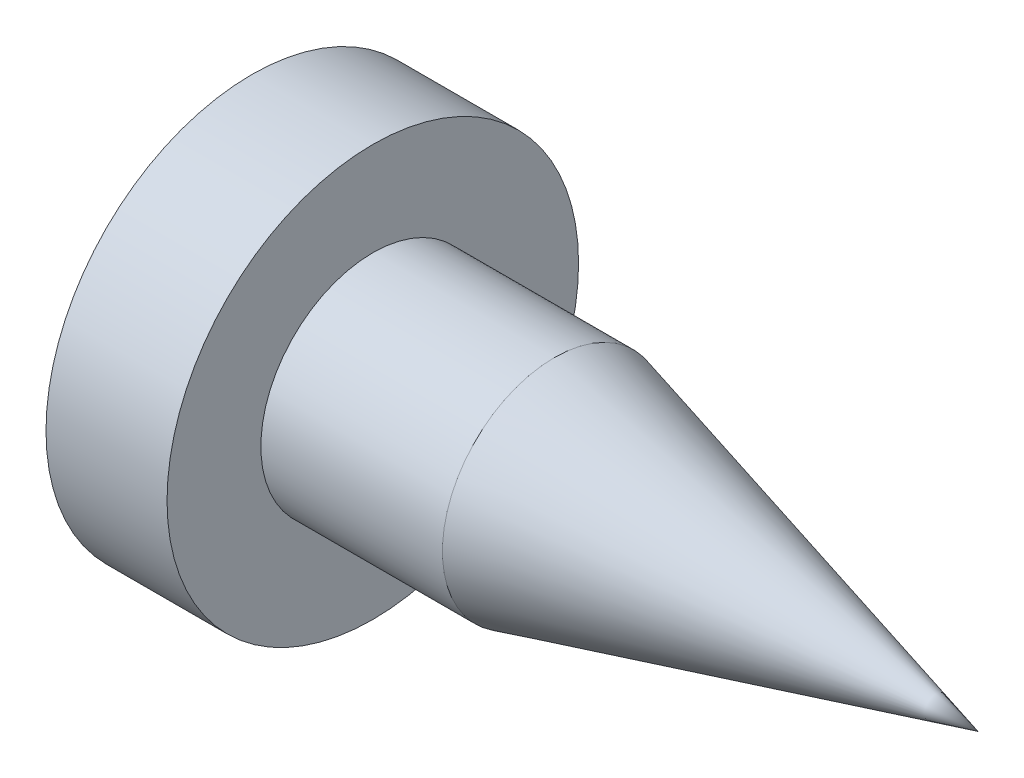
ISO-10303-21;
HEADER;
FILE_DESCRIPTION(('STEP AP214'),'2;1');
FILE_NAME('part.step','',(''),(''),'','','');
FILE_SCHEMA(('AUTOMOTIVE_DESIGN { 1 0 10303 214 1 1 1 1 }'));
ENDSEC;
DATA;
#1=APPLICATION_CONTEXT('core data for automotive mechanical design processes');
#2=APPLICATION_PROTOCOL_DEFINITION('international standard','automotive_design',2000,#1);
#3=PRODUCT_CONTEXT('',#1,'mechanical');
#4=PRODUCT('Part','Part','',(#3));
#5=PRODUCT_RELATED_PRODUCT_CATEGORY('part','',(#4));
#6=PRODUCT_DEFINITION_FORMATION('','',#4);
#7=PRODUCT_DEFINITION_CONTEXT('part definition',#1,'design');
#8=PRODUCT_DEFINITION('design','',#6,#7);
#9=PRODUCT_DEFINITION_SHAPE('','',#8);
#10=(LENGTH_UNIT() NAMED_UNIT(*) SI_UNIT(.MILLI.,.METRE.));
#11=(NAMED_UNIT(*) PLANE_ANGLE_UNIT() SI_UNIT($,.RADIAN.));
#12=(NAMED_UNIT(*) SI_UNIT($,.STERADIAN.) SOLID_ANGLE_UNIT());
#13=UNCERTAINTY_MEASURE_WITH_UNIT(LENGTH_MEASURE(1.E-05),#10,'distance_accuracy_value','');
#14=(GEOMETRIC_REPRESENTATION_CONTEXT(3) GLOBAL_UNCERTAINTY_ASSIGNED_CONTEXT((#13)) GLOBAL_UNIT_ASSIGNED_CONTEXT((#10,
#11,#12)) REPRESENTATION_CONTEXT('',''));
#15=CARTESIAN_POINT('',(0.,0.,0.));
#16=DIRECTION('',(0.,0.,1.));
#17=DIRECTION('',(1.,0.,0.));
#18=AXIS2_PLACEMENT_3D('',#15,#16,#17);
#19=CARTESIAN_POINT('',(10.,0.,0.));
#20=DIRECTION('',(-1.,0.,0.));
#21=DIRECTION('',(0.,-1.,0.));
#22=AXIS2_PLACEMENT_3D('',#19,#20,#21);
#23=CONICAL_SURFACE('',#22,0.,0.258378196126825);
#24=CARTESIAN_POINT('',(3.,0.,0.));
#25=DIRECTION('',(-1.,0.,0.));
#26=DIRECTION('',(0.,-1.,0.));
#27=AXIS2_PLACEMENT_3D('',#24,#25,#26);
#28=CIRCLE('',#27,1.85);
#29=CARTESIAN_POINT('',(3.,-1.85,0.));
#30=VERTEX_POINT('',#29);
#31=EDGE_CURVE('E241',#30,#30,#28,.T.);
#32=ORIENTED_EDGE('',*,*,#31,.F.);
#33=EDGE_LOOP('',(#32));
#34=FACE_BOUND('',#33,.T.);
#35=CARTESIAN_POINT('',(10.,0.,0.));
#36=VERTEX_POINT('',#35);
#37=VERTEX_LOOP('',#36);
#38=FACE_BOUND('',#37,.T.);
#39=ADVANCED_FACE('F30',(#34,#38),#23,.T.);
#40=CARTESIAN_POINT('',(-2.,0.,0.));
#41=DIRECTION('',(-1.,0.,0.));
#42=DIRECTION('',(0.,-1.,0.));
#43=AXIS2_PLACEMENT_3D('',#40,#41,#42);
#44=CYLINDRICAL_SURFACE('',#43,1.85);
#45=CARTESIAN_POINT('',(0.,0.,0.));
#46=DIRECTION('',(-1.,0.,0.));
#47=DIRECTION('',(0.,-1.,0.));
#48=AXIS2_PLACEMENT_3D('',#45,#46,#47);
#49=CIRCLE('',#48,1.84999999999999);
#50=CARTESIAN_POINT('',(0.,-1.84999999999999,0.));
#51=VERTEX_POINT('',#50);
#52=EDGE_CURVE('E238',#51,#51,#49,.T.);
#53=ORIENTED_EDGE('',*,*,#52,.F.);
#54=EDGE_LOOP('',(#53));
#55=FACE_BOUND('',#54,.T.);
#56=ORIENTED_EDGE('',*,*,#31,.T.);
#57=EDGE_LOOP('',(#56));
#58=FACE_BOUND('',#57,.T.);
#59=ADVANCED_FACE('F280',(#55,#58),#44,.T.);
#60=CARTESIAN_POINT('',(0.,3.4,0.));
#61=DIRECTION('',(-1.,0.,0.));
#62=DIRECTION('',(0.,-1.,0.));
#63=AXIS2_PLACEMENT_3D('',#60,#61,#62);
#64=PLANE('',#63);
#65=CARTESIAN_POINT('',(0.,0.,0.));
#66=DIRECTION('',(-1.,0.,0.));
#67=DIRECTION('',(0.,-1.,0.));
#68=AXIS2_PLACEMENT_3D('',#65,#66,#67);
#69=CIRCLE('',#68,3.4);
#70=CARTESIAN_POINT('',(0.,-3.4,0.));
#71=VERTEX_POINT('',#70);
#72=EDGE_CURVE('E235',#71,#71,#69,.T.);
#73=ORIENTED_EDGE('',*,*,#72,.F.);
#74=EDGE_LOOP('',(#73));
#75=FACE_BOUND('',#74,.T.);
#76=ORIENTED_EDGE('',*,*,#52,.T.);
#77=EDGE_LOOP('',(#76));
#78=FACE_BOUND('',#77,.T.);
#79=ADVANCED_FACE('F285',(#75,#78),#64,.F.);
#80=CARTESIAN_POINT('',(-2.,0.,0.));
#81=DIRECTION('',(-1.,0.,0.));
#82=DIRECTION('',(0.,-1.,0.));
#83=AXIS2_PLACEMENT_3D('',#80,#81,#82);
#84=CYLINDRICAL_SURFACE('',#83,3.4);
#85=CARTESIAN_POINT('',(-2.,0.,0.));
#86=DIRECTION('',(-1.,0.,0.));
#87=DIRECTION('',(0.,-1.,0.));
#88=AXIS2_PLACEMENT_3D('',#85,#86,#87);
#89=CIRCLE('',#88,3.4);
#90=CARTESIAN_POINT('',(-2.,-3.4,0.));
#91=VERTEX_POINT('',#90);
#92=EDGE_CURVE('E205',#91,#91,#89,.T.);
#93=ORIENTED_EDGE('',*,*,#92,.F.);
#94=EDGE_LOOP('',(#93));
#95=FACE_BOUND('',#94,.T.);
#96=ORIENTED_EDGE('',*,*,#72,.T.);
#97=EDGE_LOOP('',(#96));
#98=FACE_BOUND('',#97,.T.);
#99=ADVANCED_FACE('F277',(#95,#98),#84,.T.);
#100=CARTESIAN_POINT('',(3.27999999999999,0.,0.));
#101=DIRECTION('',(0.,0.,1.));
#102=DIRECTION('',(1.,0.,0.));
#103=AXIS2_PLACEMENT_3D('',#100,#101,#102);
#104=SPHERICAL_SURFACE('',#103,6.27999999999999);
#105=CARTESIAN_POINT('',(3.27999999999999,0.5,0.));
#106=DIRECTION('',(0.,1.,0.));
#107=DIRECTION('',(0.,0.,1.));
#108=AXIS2_PLACEMENT_3D('',#105,#106,#107);
#109=CIRCLE('',#108,6.26006389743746);
#110=CARTESIAN_POINT('',(-2.9408038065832,0.5,0.700000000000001));
#111=VERTEX_POINT('',#110);
#112=CARTESIAN_POINT('',(-2.65198111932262,0.5,2.));
#113=VERTEX_POINT('',#112);
#114=EDGE_CURVE('E37',#111,#113,#109,.T.);
#115=ORIENTED_EDGE('',*,*,#114,.T.);
#116=CARTESIAN_POINT('',(3.27999999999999,0.,2.));
#117=DIRECTION('',(0.,0.,1.));
#118=DIRECTION('',(1.,0.,0.));
#119=AXIS2_PLACEMENT_3D('',#116,#117,#118);
#120=CIRCLE('',#119,5.95301604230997);
#121=CARTESIAN_POINT('',(-2.65198111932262,-0.5,2.));
#122=VERTEX_POINT('',#121);
#123=EDGE_CURVE('E11',#113,#122,#120,.T.);
#124=ORIENTED_EDGE('',*,*,#123,.T.);
#125=CARTESIAN_POINT('',(3.27999999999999,-0.5,0.));
#126=DIRECTION('',(0.,-1.,0.));
#127=DIRECTION('',(0.,0.,-1.));
#128=AXIS2_PLACEMENT_3D('',#125,#126,#127);
#129=CIRCLE('',#128,6.26006389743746);
#130=CARTESIAN_POINT('',(-2.9408038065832,-0.5,0.700000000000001));
#131=VERTEX_POINT('',#130);
#132=EDGE_CURVE('E145',#122,#131,#129,.T.);
#133=ORIENTED_EDGE('',*,*,#132,.T.);
#134=CARTESIAN_POINT('',(-2.94078129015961,-0.500000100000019,0.700200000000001));
#135=CARTESIAN_POINT('',(-2.94203820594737,-0.499979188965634,0.689050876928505));
#136=CARTESIAN_POINT('',(-2.9431890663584,-0.500909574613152,0.677889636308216));
#137=CARTESIAN_POINT('',(-2.94524990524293,-0.504614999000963,0.65585978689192));
#138=CARTESIAN_POINT('',(-2.94615998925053,-0.507389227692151,0.644991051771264));
#139=CARTESIAN_POINT('',(-2.94771224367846,-0.51472725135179,0.623844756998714));
#140=CARTESIAN_POINT('',(-2.94835421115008,-0.519292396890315,0.613567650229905));
#141=CARTESIAN_POINT('',(-2.94935005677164,-0.530083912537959,0.593914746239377));
#142=CARTESIAN_POINT('',(-2.94970402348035,-0.536309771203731,0.584538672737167));
#143=CARTESIAN_POINT('',(-2.95011190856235,-0.55020035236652,0.567017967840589));
#144=CARTESIAN_POINT('',(-2.95016785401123,-0.557854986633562,0.558865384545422));
#145=CARTESIAN_POINT('',(-2.94998344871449,-0.574413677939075,0.543947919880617));
#146=CARTESIAN_POINT('',(-2.94974305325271,-0.583317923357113,0.537183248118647));
#147=CARTESIAN_POINT('',(-2.94897440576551,-0.602089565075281,0.525251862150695));
#148=CARTESIAN_POINT('',(-2.94844701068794,-0.611954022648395,0.520080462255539));
#149=CARTESIAN_POINT('',(-2.94712049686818,-0.632386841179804,0.511449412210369));
#150=CARTESIAN_POINT('',(-2.94632148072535,-0.642954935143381,0.507989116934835));
#151=CARTESIAN_POINT('',(-2.94474575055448,-0.66134277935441,0.503614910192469));
#152=CARTESIAN_POINT('',(-2.94403058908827,-0.669064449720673,0.502252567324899));
#153=CARTESIAN_POINT('',(-2.94248778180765,-0.684591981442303,0.500441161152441));
#154=CARTESIAN_POINT('',(-2.94166029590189,-0.692397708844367,0.499990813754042));
#155=CARTESIAN_POINT('',(-2.94078129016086,-0.7001999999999,0.500000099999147));
#156=B_SPLINE_CURVE_WITH_KNOTS('',3,(#134,#135,#136,#137,#138,#139,#140,#141,#142,#143,#144,
#145,#146,#147,#148,#149,#150,#151,#152,#153,#154,#155),.UNSPECIFIED.,.F.,.F.,(4,2,2,2,2,2,2,2,
2,2,4),(0.,0.033618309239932,0.0672218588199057,0.1008507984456,0.13446939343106,
0.167859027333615,0.201253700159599,0.234549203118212,0.267832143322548,0.291401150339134,
0.314936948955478),.UNSPECIFIED.);
#157=CARTESIAN_POINT('',(-2.9408038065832,-0.700000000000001,0.5));
#158=VERTEX_POINT('',#157);
#159=EDGE_CURVE('E245',#131,#158,#156,.T.);
#160=ORIENTED_EDGE('',*,*,#159,.T.);
#161=CARTESIAN_POINT('',(3.27999999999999,0.,0.5));
#162=DIRECTION('',(0.,0.,1.));
#163=DIRECTION('',(1.,0.,0.));
#164=AXIS2_PLACEMENT_3D('',#161,#162,#163);
#165=CIRCLE('',#164,6.26006389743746);
#166=CARTESIAN_POINT('',(-2.65198111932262,-2.,0.5));
#167=VERTEX_POINT('',#166);
#168=EDGE_CURVE('E253',#158,#167,#165,.T.);
#169=ORIENTED_EDGE('',*,*,#168,.T.);
#170=CARTESIAN_POINT('',(3.27999999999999,-2.,0.));
#171=DIRECTION('',(0.,-1.,0.));
#172=DIRECTION('',(0.,0.,-1.));
#173=AXIS2_PLACEMENT_3D('',#170,#171,#172);
#174=CIRCLE('',#173,5.95301604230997);
#175=CARTESIAN_POINT('',(-2.65198111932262,-2.,-0.5));
#176=VERTEX_POINT('',#175);
#177=EDGE_CURVE('E522',#167,#176,#174,.T.);
#178=ORIENTED_EDGE('',*,*,#177,.T.);
#179=CARTESIAN_POINT('',(3.27999999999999,0.,-0.5));
#180=DIRECTION('',(0.,0.,-1.));
#181=DIRECTION('',(-1.,0.,0.));
#182=AXIS2_PLACEMENT_3D('',#179,#180,#181);
#183=CIRCLE('',#182,6.26006389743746);
#184=CARTESIAN_POINT('',(-2.9408038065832,-0.700000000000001,-0.5));
#185=VERTEX_POINT('',#184);
#186=EDGE_CURVE('E504',#176,#185,#183,.T.);
#187=ORIENTED_EDGE('',*,*,#186,.T.);
#188=CARTESIAN_POINT('',(-2.94078129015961,-0.700200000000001,-0.500000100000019));
#189=CARTESIAN_POINT('',(-2.94203820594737,-0.689050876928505,-0.499979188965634));
#190=CARTESIAN_POINT('',(-2.9431890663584,-0.677889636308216,-0.500909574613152));
#191=CARTESIAN_POINT('',(-2.94524990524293,-0.65585978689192,-0.504614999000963));
#192=CARTESIAN_POINT('',(-2.94615998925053,-0.644991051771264,-0.507389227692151));
#193=CARTESIAN_POINT('',(-2.94771224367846,-0.623844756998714,-0.51472725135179));
#194=CARTESIAN_POINT('',(-2.94835421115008,-0.613567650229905,-0.519292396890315));
#195=CARTESIAN_POINT('',(-2.94935005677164,-0.593914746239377,-0.530083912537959));
#196=CARTESIAN_POINT('',(-2.94970402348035,-0.584538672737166,-0.536309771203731));
#197=CARTESIAN_POINT('',(-2.95011190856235,-0.567017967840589,-0.55020035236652));
#198=CARTESIAN_POINT('',(-2.95016785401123,-0.558865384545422,-0.557854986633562));
#199=CARTESIAN_POINT('',(-2.94998344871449,-0.543947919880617,-0.574413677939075));
#200=CARTESIAN_POINT('',(-2.94974305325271,-0.537183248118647,-0.583317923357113));
#201=CARTESIAN_POINT('',(-2.9489744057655,-0.525251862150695,-0.602089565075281));
#202=CARTESIAN_POINT('',(-2.94844701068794,-0.520080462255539,-0.611954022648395));
#203=CARTESIAN_POINT('',(-2.94712049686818,-0.511449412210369,-0.632386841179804));
#204=CARTESIAN_POINT('',(-2.94632148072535,-0.507989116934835,-0.642954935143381));
#205=CARTESIAN_POINT('',(-2.94474575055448,-0.503614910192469,-0.66134277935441));
#206=CARTESIAN_POINT('',(-2.94403058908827,-0.502252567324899,-0.669064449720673));
#207=CARTESIAN_POINT('',(-2.94248778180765,-0.500441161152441,-0.684591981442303));
#208=CARTESIAN_POINT('',(-2.94166029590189,-0.499990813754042,-0.692397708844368));
#209=CARTESIAN_POINT('',(-2.94078129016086,-0.500000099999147,-0.7001999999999));
#210=B_SPLINE_CURVE_WITH_KNOTS('',3,(#188,#189,#190,#191,#192,#193,#194,#195,#196,#197,#198,
#199,#200,#201,#202,#203,#204,#205,#206,#207,#208,#209),.UNSPECIFIED.,.F.,.F.,(4,2,2,2,2,2,2,2,
2,2,4),(0.,0.0336183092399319,0.0672218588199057,0.1008507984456,0.13446939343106,
0.167859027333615,0.201253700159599,0.234549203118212,0.267832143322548,0.291401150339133,
0.314936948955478),.UNSPECIFIED.);
#211=CARTESIAN_POINT('',(-2.9408038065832,-0.5,-0.700000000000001));
#212=VERTEX_POINT('',#211);
#213=EDGE_CURVE('E496',#185,#212,#210,.T.);
#214=ORIENTED_EDGE('',*,*,#213,.T.);
#215=CARTESIAN_POINT('',(3.27999999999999,-0.5,0.));
#216=DIRECTION('',(0.,-1.,0.));
#217=DIRECTION('',(0.,0.,-1.));
#218=AXIS2_PLACEMENT_3D('',#215,#216,#217);
#219=CIRCLE('',#218,6.26006389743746);
#220=CARTESIAN_POINT('',(-2.65198111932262,-0.5,-2.));
#221=VERTEX_POINT('',#220);
#222=EDGE_CURVE('E503',#212,#221,#219,.T.);
#223=ORIENTED_EDGE('',*,*,#222,.T.);
#224=CARTESIAN_POINT('',(3.27999999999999,0.,-2.));
#225=DIRECTION('',(0.,0.,-1.));
#226=DIRECTION('',(-1.,0.,0.));
#227=AXIS2_PLACEMENT_3D('',#224,#225,#226);
#228=CIRCLE('',#227,5.95301604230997);
#229=CARTESIAN_POINT('',(-2.65198111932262,0.5,-2.));
#230=VERTEX_POINT('',#229);
#231=EDGE_CURVE('E506',#221,#230,#228,.T.);
#232=ORIENTED_EDGE('',*,*,#231,.T.);
#233=CARTESIAN_POINT('',(3.27999999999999,0.5,0.));
#234=DIRECTION('',(0.,1.,0.));
#235=DIRECTION('',(0.,0.,1.));
#236=AXIS2_PLACEMENT_3D('',#233,#234,#235);
#237=CIRCLE('',#236,6.26006389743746);
#238=CARTESIAN_POINT('',(-2.9408038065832,0.5,-0.700000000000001));
#239=VERTEX_POINT('',#238);
#240=EDGE_CURVE('E491',#230,#239,#237,.T.);
#241=ORIENTED_EDGE('',*,*,#240,.T.);
#242=CARTESIAN_POINT('',(-2.94078129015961,0.500000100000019,-0.700200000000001));
#243=CARTESIAN_POINT('',(-2.94203820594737,0.499979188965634,-0.689050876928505));
#244=CARTESIAN_POINT('',(-2.9431890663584,0.500909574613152,-0.677889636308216));
#245=CARTESIAN_POINT('',(-2.94524990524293,0.504614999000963,-0.65585978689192));
#246=CARTESIAN_POINT('',(-2.94615998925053,0.507389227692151,-0.644991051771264));
#247=CARTESIAN_POINT('',(-2.94771224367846,0.51472725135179,-0.623844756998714));
#248=CARTESIAN_POINT('',(-2.94835421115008,0.519292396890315,-0.613567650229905));
#249=CARTESIAN_POINT('',(-2.94935005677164,0.530083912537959,-0.593914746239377));
#250=CARTESIAN_POINT('',(-2.94970402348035,0.536309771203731,-0.584538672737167));
#251=CARTESIAN_POINT('',(-2.95011190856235,0.55020035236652,-0.567017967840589));
#252=CARTESIAN_POINT('',(-2.95016785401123,0.557854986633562,-0.558865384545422));
#253=CARTESIAN_POINT('',(-2.94998344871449,0.574413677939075,-0.543947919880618));
#254=CARTESIAN_POINT('',(-2.94974305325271,0.583317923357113,-0.537183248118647));
#255=CARTESIAN_POINT('',(-2.9489744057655,0.602089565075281,-0.525251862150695));
#256=CARTESIAN_POINT('',(-2.94844701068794,0.611954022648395,-0.520080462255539));
#257=CARTESIAN_POINT('',(-2.94712049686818,0.632386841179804,-0.511449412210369));
#258=CARTESIAN_POINT('',(-2.94632148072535,0.642954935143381,-0.507989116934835));
#259=CARTESIAN_POINT('',(-2.94474575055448,0.66134277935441,-0.503614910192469));
#260=CARTESIAN_POINT('',(-2.94403058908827,0.669064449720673,-0.502252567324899));
#261=CARTESIAN_POINT('',(-2.94248778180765,0.684591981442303,-0.500441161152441));
#262=CARTESIAN_POINT('',(-2.94166029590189,0.692397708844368,-0.499990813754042));
#263=CARTESIAN_POINT('',(-2.94078129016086,0.7001999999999,-0.500000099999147));
#264=B_SPLINE_CURVE_WITH_KNOTS('',3,(#242,#243,#244,#245,#246,#247,#248,#249,#250,#251,#252,
#253,#254,#255,#256,#257,#258,#259,#260,#261,#262,#263),.UNSPECIFIED.,.F.,.F.,(4,2,2,2,2,2,2,2,
2,2,4),(0.,0.0336183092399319,0.0672218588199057,0.1008507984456,0.13446939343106,
0.167859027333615,0.201253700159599,0.234549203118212,0.267832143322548,0.291401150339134,
0.314936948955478),.UNSPECIFIED.);
#265=CARTESIAN_POINT('',(-2.9408038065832,0.700000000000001,-0.5));
#266=VERTEX_POINT('',#265);
#267=EDGE_CURVE('E484',#239,#266,#264,.T.);
#268=ORIENTED_EDGE('',*,*,#267,.T.);
#269=CARTESIAN_POINT('',(3.27999999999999,0.,-0.5));
#270=DIRECTION('',(0.,0.,-1.));
#271=DIRECTION('',(-1.,0.,0.));
#272=AXIS2_PLACEMENT_3D('',#269,#270,#271);
#273=CIRCLE('',#272,6.26006389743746);
#274=CARTESIAN_POINT('',(-2.65198111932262,2.,-0.5));
#275=VERTEX_POINT('',#274);
#276=EDGE_CURVE('E483',#266,#275,#273,.T.);
#277=ORIENTED_EDGE('',*,*,#276,.T.);
#278=CARTESIAN_POINT('',(3.27999999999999,2.,0.));
#279=DIRECTION('',(0.,1.,0.));
#280=DIRECTION('',(0.,0.,1.));
#281=AXIS2_PLACEMENT_3D('',#278,#279,#280);
#282=CIRCLE('',#281,5.95301604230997);
#283=CARTESIAN_POINT('',(-2.65198111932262,2.,0.5));
#284=VERTEX_POINT('',#283);
#285=EDGE_CURVE('E479',#275,#284,#282,.T.);
#286=ORIENTED_EDGE('',*,*,#285,.T.);
#287=CARTESIAN_POINT('',(3.27999999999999,0.,0.5));
#288=DIRECTION('',(0.,0.,1.));
#289=DIRECTION('',(1.,0.,0.));
#290=AXIS2_PLACEMENT_3D('',#287,#288,#289);
#291=CIRCLE('',#290,6.26006389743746);
#292=CARTESIAN_POINT('',(-2.9408038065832,0.700000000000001,0.5));
#293=VERTEX_POINT('',#292);
#294=EDGE_CURVE('E468',#284,#293,#291,.T.);
#295=ORIENTED_EDGE('',*,*,#294,.T.);
#296=CARTESIAN_POINT('',(-2.94078129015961,0.700200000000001,0.500000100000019));
#297=CARTESIAN_POINT('',(-2.94203820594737,0.689050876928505,0.499979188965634));
#298=CARTESIAN_POINT('',(-2.9431890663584,0.677889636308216,0.500909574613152));
#299=CARTESIAN_POINT('',(-2.94524990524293,0.65585978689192,0.504614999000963));
#300=CARTESIAN_POINT('',(-2.94615998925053,0.644991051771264,0.507389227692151));
#301=CARTESIAN_POINT('',(-2.94771224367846,0.623844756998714,0.51472725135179));
#302=CARTESIAN_POINT('',(-2.94835421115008,0.613567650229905,0.519292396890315));
#303=CARTESIAN_POINT('',(-2.94935005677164,0.593914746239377,0.530083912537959));
#304=CARTESIAN_POINT('',(-2.94970402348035,0.584538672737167,0.536309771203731));
#305=CARTESIAN_POINT('',(-2.95011190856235,0.567017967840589,0.55020035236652));
#306=CARTESIAN_POINT('',(-2.95016785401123,0.558865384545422,0.557854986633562));
#307=CARTESIAN_POINT('',(-2.94998344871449,0.543947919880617,0.574413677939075));
#308=CARTESIAN_POINT('',(-2.94974305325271,0.537183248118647,0.583317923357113));
#309=CARTESIAN_POINT('',(-2.9489744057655,0.525251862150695,0.602089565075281));
#310=CARTESIAN_POINT('',(-2.94844701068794,0.520080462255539,0.611954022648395));
#311=CARTESIAN_POINT('',(-2.94712049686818,0.511449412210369,0.632386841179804));
#312=CARTESIAN_POINT('',(-2.94632148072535,0.507989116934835,0.642954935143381));
#313=CARTESIAN_POINT('',(-2.94474575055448,0.503614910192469,0.66134277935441));
#314=CARTESIAN_POINT('',(-2.94403058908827,0.502252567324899,0.669064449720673));
#315=CARTESIAN_POINT('',(-2.94248778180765,0.500441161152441,0.684591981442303));
#316=CARTESIAN_POINT('',(-2.94166029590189,0.499990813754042,0.692397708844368));
#317=CARTESIAN_POINT('',(-2.94078129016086,0.500000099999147,0.7001999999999));
#318=B_SPLINE_CURVE_WITH_KNOTS('',3,(#296,#297,#298,#299,#300,#301,#302,#303,#304,#305,#306,
#307,#308,#309,#310,#311,#312,#313,#314,#315,#316,#317),.UNSPECIFIED.,.F.,.F.,(4,2,2,2,2,2,2,2,
2,2,4),(0.,0.0336183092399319,0.0672218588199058,0.1008507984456,0.13446939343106,
0.167859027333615,0.201253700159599,0.234549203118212,0.267832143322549,0.291401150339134,
0.314936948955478),.UNSPECIFIED.);
#319=EDGE_CURVE('E462',#293,#111,#318,.T.);
#320=ORIENTED_EDGE('',*,*,#319,.T.);
#321=EDGE_LOOP('',(#115,#124,#133,#160,#169,#178,#187,#214,#223,#232,#241,#268,#277,#286,#295,#320));
#322=FACE_BOUND('',#321,.T.);
#323=ORIENTED_EDGE('',*,*,#92,.T.);
#324=EDGE_LOOP('',(#323));
#325=FACE_BOUND('',#324,.T.);
#326=ADVANCED_FACE('F255',(#322,#325),#104,.T.);
#327=CARTESIAN_POINT('',(-11.,-0.5,2.));
#328=DIRECTION('',(0.,0.,1.));
#329=DIRECTION('',(1.,0.,0.));
#330=AXIS2_PLACEMENT_3D('',#327,#328,#329);
#331=PLANE('',#330);
#332=DIRECTION('',(1.,0.,0.));
#333=VECTOR('',#332,1.);
#334=CARTESIAN_POINT('',(-11.,0.5,2.));
#335=LINE('',#334,#333);
#336=CARTESIAN_POINT('',(-1.,0.5,2.));
#337=VERTEX_POINT('',#336);
#338=EDGE_CURVE('E163',#113,#337,#335,.T.);
#339=ORIENTED_EDGE('',*,*,#338,.T.);
#340=DIRECTION('',(0.,-1.,0.));
#341=VECTOR('',#340,1.);
#342=CARTESIAN_POINT('',(-1.,-0.5,2.));
#343=LINE('',#342,#341);
#344=CARTESIAN_POINT('',(-1.,-0.5,2.));
#345=VERTEX_POINT('',#344);
#346=EDGE_CURVE('E155',#337,#345,#343,.T.);
#347=ORIENTED_EDGE('',*,*,#346,.T.);
#348=DIRECTION('',(1.,0.,0.));
#349=VECTOR('',#348,1.);
#350=CARTESIAN_POINT('',(-11.,-0.5,2.));
#351=LINE('',#350,#349);
#352=EDGE_CURVE('E140',#122,#345,#351,.T.);
#353=ORIENTED_EDGE('',*,*,#352,.F.);
#354=ORIENTED_EDGE('',*,*,#123,.F.);
#355=EDGE_LOOP('',(#339,#347,#353,#354));
#356=FACE_BOUND('',#355,.T.);
#357=ADVANCED_FACE('F161',(#356),#331,.F.);
#358=CARTESIAN_POINT('',(-11.,0.5,2.));
#359=DIRECTION('',(0.,1.,0.));
#360=DIRECTION('',(0.,0.,1.));
#361=AXIS2_PLACEMENT_3D('',#358,#359,#360);
#362=PLANE('',#361);
#363=DIRECTION('',(1.,0.,0.));
#364=VECTOR('',#363,1.);
#365=CARTESIAN_POINT('',(-11.,0.5,0.700000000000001));
#366=LINE('',#365,#364);
#367=CARTESIAN_POINT('',(-1.,0.5,0.700000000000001));
#368=VERTEX_POINT('',#367);
#369=EDGE_CURVE('E206',#111,#368,#366,.T.);
#370=ORIENTED_EDGE('',*,*,#369,.T.);
#371=DIRECTION('',(0.,0.,1.));
#372=VECTOR('',#371,1.);
#373=CARTESIAN_POINT('',(-1.,0.5,2.));
#374=LINE('',#373,#372);
#375=EDGE_CURVE('E148',#368,#337,#374,.T.);
#376=ORIENTED_EDGE('',*,*,#375,.T.);
#377=ORIENTED_EDGE('',*,*,#338,.F.);
#378=ORIENTED_EDGE('',*,*,#114,.F.);
#379=EDGE_LOOP('',(#370,#376,#377,#378));
#380=FACE_BOUND('',#379,.T.);
#381=ADVANCED_FACE('F269',(#380),#362,.F.);
#382=CARTESIAN_POINT('',(-11.,0.7,0.7));
#383=DIRECTION('',(1.,0.,0.));
#384=DIRECTION('',(0.,0.,-1.));
#385=AXIS2_PLACEMENT_3D('',#382,#383,#384);
#386=CYLINDRICAL_SURFACE('',#385,0.2);
#387=DIRECTION('',(1.,0.,0.));
#388=VECTOR('',#387,1.);
#389=CARTESIAN_POINT('',(-11.,0.700000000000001,0.5));
#390=LINE('',#389,#388);
#391=CARTESIAN_POINT('',(-1.,0.700000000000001,0.5));
#392=VERTEX_POINT('',#391);
#393=EDGE_CURVE('E208',#293,#392,#390,.T.);
#394=ORIENTED_EDGE('',*,*,#393,.T.);
#395=CARTESIAN_POINT('',(-1.,0.7,0.7));
#396=DIRECTION('',(-1.,0.,0.));
#397=DIRECTION('',(0.,0.,1.));
#398=AXIS2_PLACEMENT_3D('',#395,#396,#397);
#399=CIRCLE('',#398,0.2);
#400=EDGE_CURVE('E200',#392,#368,#399,.T.);
#401=ORIENTED_EDGE('',*,*,#400,.T.);
#402=ORIENTED_EDGE('',*,*,#369,.F.);
#403=ORIENTED_EDGE('',*,*,#319,.F.);
#404=EDGE_LOOP('',(#394,#401,#402,#403));
#405=FACE_BOUND('',#404,.T.);
#406=ADVANCED_FACE('F274',(#405),#386,.T.);
#407=CARTESIAN_POINT('',(-11.,0.700000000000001,0.5));
#408=DIRECTION('',(0.,0.,1.));
#409=DIRECTION('',(1.,0.,0.));
#410=AXIS2_PLACEMENT_3D('',#407,#408,#409);
#411=PLANE('',#410);
#412=DIRECTION('',(1.,0.,0.));
#413=VECTOR('',#412,1.);
#414=CARTESIAN_POINT('',(-11.,2.,0.5));
#415=LINE('',#414,#413);
#416=CARTESIAN_POINT('',(-1.,2.,0.5));
#417=VERTEX_POINT('',#416);
#418=EDGE_CURVE('E210',#284,#417,#415,.T.);
#419=ORIENTED_EDGE('',*,*,#418,.T.);
#420=DIRECTION('',(0.,-1.,0.));
#421=VECTOR('',#420,1.);
#422=CARTESIAN_POINT('',(-1.,0.700000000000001,0.5));
#423=LINE('',#422,#421);
#424=EDGE_CURVE('E197',#417,#392,#423,.T.);
#425=ORIENTED_EDGE('',*,*,#424,.T.);
#426=ORIENTED_EDGE('',*,*,#393,.F.);
#427=ORIENTED_EDGE('',*,*,#294,.F.);
#428=EDGE_LOOP('',(#419,#425,#426,#427));
#429=FACE_BOUND('',#428,.T.);
#430=ADVANCED_FACE('F329',(#429),#411,.F.);
#431=CARTESIAN_POINT('',(-11.,2.,0.5));
#432=DIRECTION('',(0.,1.,0.));
#433=DIRECTION('',(0.,0.,1.));
#434=AXIS2_PLACEMENT_3D('',#431,#432,#433);
#435=PLANE('',#434);
#436=DIRECTION('',(1.,0.,0.));
#437=VECTOR('',#436,1.);
#438=CARTESIAN_POINT('',(-11.,2.,-0.5));
#439=LINE('',#438,#437);
#440=CARTESIAN_POINT('',(-1.,2.,-0.5));
#441=VERTEX_POINT('',#440);
#442=EDGE_CURVE('E212',#275,#441,#439,.T.);
#443=ORIENTED_EDGE('',*,*,#442,.T.);
#444=DIRECTION('',(0.,0.,1.));
#445=VECTOR('',#444,1.);
#446=CARTESIAN_POINT('',(-1.,2.,0.5));
#447=LINE('',#446,#445);
#448=EDGE_CURVE('E194',#441,#417,#447,.T.);
#449=ORIENTED_EDGE('',*,*,#448,.T.);
#450=ORIENTED_EDGE('',*,*,#418,.F.);
#451=ORIENTED_EDGE('',*,*,#285,.F.);
#452=EDGE_LOOP('',(#443,#449,#450,#451));
#453=FACE_BOUND('',#452,.T.);
#454=ADVANCED_FACE('F339',(#453),#435,.F.);
#455=CARTESIAN_POINT('',(-11.,0.700000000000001,-0.5));
#456=DIRECTION('',(0.,0.,-1.));
#457=DIRECTION('',(-1.,0.,0.));
#458=AXIS2_PLACEMENT_3D('',#455,#456,#457);
#459=PLANE('',#458);
#460=DIRECTION('',(1.,0.,0.));
#461=VECTOR('',#460,1.);
#462=CARTESIAN_POINT('',(-11.,0.700000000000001,-0.5));
#463=LINE('',#462,#461);
#464=CARTESIAN_POINT('',(-1.,0.700000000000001,-0.5));
#465=VERTEX_POINT('',#464);
#466=EDGE_CURVE('E214',#266,#465,#463,.T.);
#467=ORIENTED_EDGE('',*,*,#466,.T.);
#468=DIRECTION('',(0.,1.,0.));
#469=VECTOR('',#468,1.);
#470=CARTESIAN_POINT('',(-1.,0.700000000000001,-0.5));
#471=LINE('',#470,#469);
#472=EDGE_CURVE('E191',#465,#441,#471,.T.);
#473=ORIENTED_EDGE('',*,*,#472,.T.);
#474=ORIENTED_EDGE('',*,*,#442,.F.);
#475=ORIENTED_EDGE('',*,*,#276,.F.);
#476=EDGE_LOOP('',(#467,#473,#474,#475));
#477=FACE_BOUND('',#476,.T.);
#478=ADVANCED_FACE('F349',(#477),#459,.F.);
#479=CARTESIAN_POINT('',(-11.,0.7,-0.7));
#480=DIRECTION('',(1.,0.,0.));
#481=DIRECTION('',(0.,0.,-1.));
#482=AXIS2_PLACEMENT_3D('',#479,#480,#481);
#483=CYLINDRICAL_SURFACE('',#482,0.2);
#484=DIRECTION('',(1.,0.,0.));
#485=VECTOR('',#484,1.);
#486=CARTESIAN_POINT('',(-11.,0.5,-0.700000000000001));
#487=LINE('',#486,#485);
#488=CARTESIAN_POINT('',(-1.,0.5,-0.700000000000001));
#489=VERTEX_POINT('',#488);
#490=EDGE_CURVE('E216',#239,#489,#487,.T.);
#491=ORIENTED_EDGE('',*,*,#490,.T.);
#492=CARTESIAN_POINT('',(-1.,0.7,-0.7));
#493=DIRECTION('',(-1.,0.,0.));
#494=DIRECTION('',(0.,0.,1.));
#495=AXIS2_PLACEMENT_3D('',#492,#493,#494);
#496=CIRCLE('',#495,0.2);
#497=EDGE_CURVE('E188',#489,#465,#496,.T.);
#498=ORIENTED_EDGE('',*,*,#497,.T.);
#499=ORIENTED_EDGE('',*,*,#466,.F.);
#500=ORIENTED_EDGE('',*,*,#267,.F.);
#501=EDGE_LOOP('',(#491,#498,#499,#500));
#502=FACE_BOUND('',#501,.T.);
#503=ADVANCED_FACE('F359',(#502),#483,.T.);
#504=CARTESIAN_POINT('',(-11.,0.5,-0.700000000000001));
#505=DIRECTION('',(0.,1.,0.));
#506=DIRECTION('',(0.,0.,1.));
#507=AXIS2_PLACEMENT_3D('',#504,#505,#506);
#508=PLANE('',#507);
#509=DIRECTION('',(1.,0.,0.));
#510=VECTOR('',#509,1.);
#511=CARTESIAN_POINT('',(-11.,0.5,-2.));
#512=LINE('',#511,#510);
#513=CARTESIAN_POINT('',(-1.,0.5,-2.));
#514=VERTEX_POINT('',#513);
#515=EDGE_CURVE('E218',#230,#514,#512,.T.);
#516=ORIENTED_EDGE('',*,*,#515,.T.);
#517=DIRECTION('',(0.,0.,1.));
#518=VECTOR('',#517,1.);
#519=CARTESIAN_POINT('',(-1.,0.5,-0.700000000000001));
#520=LINE('',#519,#518);
#521=EDGE_CURVE('E185',#514,#489,#520,.T.);
#522=ORIENTED_EDGE('',*,*,#521,.T.);
#523=ORIENTED_EDGE('',*,*,#490,.F.);
#524=ORIENTED_EDGE('',*,*,#240,.F.);
#525=EDGE_LOOP('',(#516,#522,#523,#524));
#526=FACE_BOUND('',#525,.T.);
#527=ADVANCED_FACE('F369',(#526),#508,.F.);
#528=CARTESIAN_POINT('',(-11.,-0.5,-2.));
#529=DIRECTION('',(0.,0.,-1.));
#530=DIRECTION('',(-1.,0.,0.));
#531=AXIS2_PLACEMENT_3D('',#528,#529,#530);
#532=PLANE('',#531);
#533=DIRECTION('',(1.,0.,0.));
#534=VECTOR('',#533,1.);
#535=CARTESIAN_POINT('',(-11.,-0.5,-2.));
#536=LINE('',#535,#534);
#537=CARTESIAN_POINT('',(-1.,-0.5,-2.));
#538=VERTEX_POINT('',#537);
#539=EDGE_CURVE('E220',#221,#538,#536,.T.);
#540=ORIENTED_EDGE('',*,*,#539,.T.);
#541=DIRECTION('',(0.,1.,0.));
#542=VECTOR('',#541,1.);
#543=CARTESIAN_POINT('',(-1.,-0.5,-2.));
#544=LINE('',#543,#542);
#545=EDGE_CURVE('E182',#538,#514,#544,.T.);
#546=ORIENTED_EDGE('',*,*,#545,.T.);
#547=ORIENTED_EDGE('',*,*,#515,.F.);
#548=ORIENTED_EDGE('',*,*,#231,.F.);
#549=EDGE_LOOP('',(#540,#546,#547,#548));
#550=FACE_BOUND('',#549,.T.);
#551=ADVANCED_FACE('F379',(#550),#532,.F.);
#552=CARTESIAN_POINT('',(-11.,-0.5,-0.700000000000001));
#553=DIRECTION('',(0.,-1.,0.));
#554=DIRECTION('',(0.,0.,-1.));
#555=AXIS2_PLACEMENT_3D('',#552,#553,#554);
#556=PLANE('',#555);
#557=DIRECTION('',(1.,0.,0.));
#558=VECTOR('',#557,1.);
#559=CARTESIAN_POINT('',(-11.,-0.5,-0.700000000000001));
#560=LINE('',#559,#558);
#561=CARTESIAN_POINT('',(-1.,-0.5,-0.700000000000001));
#562=VERTEX_POINT('',#561);
#563=EDGE_CURVE('E222',#212,#562,#560,.T.);
#564=ORIENTED_EDGE('',*,*,#563,.T.);
#565=DIRECTION('',(0.,0.,-1.));
#566=VECTOR('',#565,1.);
#567=CARTESIAN_POINT('',(-1.,-0.5,-0.700000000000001));
#568=LINE('',#567,#566);
#569=EDGE_CURVE('E179',#562,#538,#568,.T.);
#570=ORIENTED_EDGE('',*,*,#569,.T.);
#571=ORIENTED_EDGE('',*,*,#539,.F.);
#572=ORIENTED_EDGE('',*,*,#222,.F.);
#573=EDGE_LOOP('',(#564,#570,#571,#572));
#574=FACE_BOUND('',#573,.T.);
#575=ADVANCED_FACE('F389',(#574),#556,.F.);
#576=CARTESIAN_POINT('',(-11.,-0.7,-0.7));
#577=DIRECTION('',(1.,0.,0.));
#578=DIRECTION('',(0.,0.,-1.));
#579=AXIS2_PLACEMENT_3D('',#576,#577,#578);
#580=CYLINDRICAL_SURFACE('',#579,0.2);
#581=DIRECTION('',(1.,0.,0.));
#582=VECTOR('',#581,1.);
#583=CARTESIAN_POINT('',(-11.,-0.700000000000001,-0.5));
#584=LINE('',#583,#582);
#585=CARTESIAN_POINT('',(-1.,-0.700000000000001,-0.5));
#586=VERTEX_POINT('',#585);
#587=EDGE_CURVE('E224',#185,#586,#584,.T.);
#588=ORIENTED_EDGE('',*,*,#587,.T.);
#589=CARTESIAN_POINT('',(-1.,-0.7,-0.7));
#590=DIRECTION('',(-1.,0.,0.));
#591=DIRECTION('',(0.,0.,1.));
#592=AXIS2_PLACEMENT_3D('',#589,#590,#591);
#593=CIRCLE('',#592,0.2);
#594=EDGE_CURVE('E176',#586,#562,#593,.T.);
#595=ORIENTED_EDGE('',*,*,#594,.T.);
#596=ORIENTED_EDGE('',*,*,#563,.F.);
#597=ORIENTED_EDGE('',*,*,#213,.F.);
#598=EDGE_LOOP('',(#588,#595,#596,#597));
#599=FACE_BOUND('',#598,.T.);
#600=ADVANCED_FACE('F399',(#599),#580,.T.);
#601=CARTESIAN_POINT('',(-11.,-2.,-0.5));
#602=DIRECTION('',(0.,0.,-1.));
#603=DIRECTION('',(-1.,0.,0.));
#604=AXIS2_PLACEMENT_3D('',#601,#602,#603);
#605=PLANE('',#604);
#606=DIRECTION('',(1.,0.,0.));
#607=VECTOR('',#606,1.);
#608=CARTESIAN_POINT('',(-11.,-2.,-0.5));
#609=LINE('',#608,#607);
#610=CARTESIAN_POINT('',(-1.,-2.,-0.5));
#611=VERTEX_POINT('',#610);
#612=EDGE_CURVE('E226',#176,#611,#609,.T.);
#613=ORIENTED_EDGE('',*,*,#612,.T.);
#614=DIRECTION('',(0.,1.,0.));
#615=VECTOR('',#614,1.);
#616=CARTESIAN_POINT('',(-1.,-2.,-0.5));
#617=LINE('',#616,#615);
#618=EDGE_CURVE('E173',#611,#586,#617,.T.);
#619=ORIENTED_EDGE('',*,*,#618,.T.);
#620=ORIENTED_EDGE('',*,*,#587,.F.);
#621=ORIENTED_EDGE('',*,*,#186,.F.);
#622=EDGE_LOOP('',(#613,#619,#620,#621));
#623=FACE_BOUND('',#622,.T.);
#624=ADVANCED_FACE('F409',(#623),#605,.F.);
#625=CARTESIAN_POINT('',(-11.,-2.,0.5));
#626=DIRECTION('',(0.,-1.,0.));
#627=DIRECTION('',(0.,0.,-1.));
#628=AXIS2_PLACEMENT_3D('',#625,#626,#627);
#629=PLANE('',#628);
#630=DIRECTION('',(1.,0.,0.));
#631=VECTOR('',#630,1.);
#632=CARTESIAN_POINT('',(-11.,-2.,0.5));
#633=LINE('',#632,#631);
#634=CARTESIAN_POINT('',(-1.,-2.,0.5));
#635=VERTEX_POINT('',#634);
#636=EDGE_CURVE('E228',#167,#635,#633,.T.);
#637=ORIENTED_EDGE('',*,*,#636,.T.);
#638=DIRECTION('',(0.,0.,-1.));
#639=VECTOR('',#638,1.);
#640=CARTESIAN_POINT('',(-1.,-2.,0.5));
#641=LINE('',#640,#639);
#642=EDGE_CURVE('E170',#635,#611,#641,.T.);
#643=ORIENTED_EDGE('',*,*,#642,.T.);
#644=ORIENTED_EDGE('',*,*,#612,.F.);
#645=ORIENTED_EDGE('',*,*,#177,.F.);
#646=EDGE_LOOP('',(#637,#643,#644,#645));
#647=FACE_BOUND('',#646,.T.);
#648=ADVANCED_FACE('F419',(#647),#629,.F.);
#649=CARTESIAN_POINT('',(-11.,-2.,0.5));
#650=DIRECTION('',(0.,0.,1.));
#651=DIRECTION('',(1.,0.,0.));
#652=AXIS2_PLACEMENT_3D('',#649,#650,#651);
#653=PLANE('',#652);
#654=DIRECTION('',(1.,0.,0.));
#655=VECTOR('',#654,1.);
#656=CARTESIAN_POINT('',(-11.,-0.700000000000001,0.5));
#657=LINE('',#656,#655);
#658=CARTESIAN_POINT('',(-1.,-0.700000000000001,0.5));
#659=VERTEX_POINT('',#658);
#660=EDGE_CURVE('E230',#158,#659,#657,.T.);
#661=ORIENTED_EDGE('',*,*,#660,.T.);
#662=DIRECTION('',(0.,-1.,0.));
#663=VECTOR('',#662,1.);
#664=CARTESIAN_POINT('',(-1.,-2.,0.5));
#665=LINE('',#664,#663);
#666=EDGE_CURVE('E167',#659,#635,#665,.T.);
#667=ORIENTED_EDGE('',*,*,#666,.T.);
#668=ORIENTED_EDGE('',*,*,#636,.F.);
#669=ORIENTED_EDGE('',*,*,#168,.F.);
#670=EDGE_LOOP('',(#661,#667,#668,#669));
#671=FACE_BOUND('',#670,.T.);
#672=ADVANCED_FACE('F264',(#671),#653,.F.);
#673=CARTESIAN_POINT('',(-11.,-0.7,0.7));
#674=DIRECTION('',(1.,0.,0.));
#675=DIRECTION('',(0.,0.,-1.));
#676=AXIS2_PLACEMENT_3D('',#673,#674,#675);
#677=CYLINDRICAL_SURFACE('',#676,0.2);
#678=DIRECTION('',(1.,0.,0.));
#679=VECTOR('',#678,1.);
#680=CARTESIAN_POINT('',(-11.,-0.5,0.700000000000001));
#681=LINE('',#680,#679);
#682=CARTESIAN_POINT('',(-1.,-0.5,0.700000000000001));
#683=VERTEX_POINT('',#682);
#684=EDGE_CURVE('E44',#131,#683,#681,.T.);
#685=ORIENTED_EDGE('',*,*,#684,.T.);
#686=CARTESIAN_POINT('',(-1.,-0.7,0.7));
#687=DIRECTION('',(-1.,0.,0.));
#688=DIRECTION('',(0.,0.,1.));
#689=AXIS2_PLACEMENT_3D('',#686,#687,#688);
#690=CIRCLE('',#689,0.2);
#691=EDGE_CURVE('E159',#683,#659,#690,.T.);
#692=ORIENTED_EDGE('',*,*,#691,.T.);
#693=ORIENTED_EDGE('',*,*,#660,.F.);
#694=ORIENTED_EDGE('',*,*,#159,.F.);
#695=EDGE_LOOP('',(#685,#692,#693,#694));
#696=FACE_BOUND('',#695,.T.);
#697=ADVANCED_FACE('F259',(#696),#677,.T.);
#698=CARTESIAN_POINT('',(-11.,-0.5,2.));
#699=DIRECTION('',(0.,-1.,0.));
#700=DIRECTION('',(0.,0.,-1.));
#701=AXIS2_PLACEMENT_3D('',#698,#699,#700);
#702=PLANE('',#701);
#703=ORIENTED_EDGE('',*,*,#352,.T.);
#704=DIRECTION('',(0.,0.,-1.));
#705=VECTOR('',#704,1.);
#706=CARTESIAN_POINT('',(-1.,-0.5,2.));
#707=LINE('',#706,#705);
#708=EDGE_CURVE('E143',#345,#683,#707,.T.);
#709=ORIENTED_EDGE('',*,*,#708,.T.);
#710=ORIENTED_EDGE('',*,*,#684,.F.);
#711=ORIENTED_EDGE('',*,*,#132,.F.);
#712=EDGE_LOOP('',(#703,#709,#710,#711));
#713=FACE_BOUND('',#712,.T.);
#714=ADVANCED_FACE('F142',(#713),#702,.F.);
#715=CARTESIAN_POINT('',(-1.,0.7,0.7));
#716=DIRECTION('',(-1.,0.,0.));
#717=DIRECTION('',(0.,0.,1.));
#718=AXIS2_PLACEMENT_3D('',#715,#716,#717);
#719=PLANE('',#718);
#720=ORIENTED_EDGE('',*,*,#346,.F.);
#721=ORIENTED_EDGE('',*,*,#375,.F.);
#722=ORIENTED_EDGE('',*,*,#400,.F.);
#723=ORIENTED_EDGE('',*,*,#424,.F.);
#724=ORIENTED_EDGE('',*,*,#448,.F.);
#725=ORIENTED_EDGE('',*,*,#472,.F.);
#726=ORIENTED_EDGE('',*,*,#497,.F.);
#727=ORIENTED_EDGE('',*,*,#521,.F.);
#728=ORIENTED_EDGE('',*,*,#545,.F.);
#729=ORIENTED_EDGE('',*,*,#569,.F.);
#730=ORIENTED_EDGE('',*,*,#594,.F.);
#731=ORIENTED_EDGE('',*,*,#618,.F.);
#732=ORIENTED_EDGE('',*,*,#642,.F.);
#733=ORIENTED_EDGE('',*,*,#666,.F.);
#734=ORIENTED_EDGE('',*,*,#691,.F.);
#735=ORIENTED_EDGE('',*,*,#708,.F.);
#736=EDGE_LOOP('',(#720,#721,#722,#723,#724,#725,#726,#727,#728,#729,#730,#731,#732,#733,#734,#735));
#737=FACE_BOUND('',#736,.T.);
#738=ADVANCED_FACE('F153',(#737),#719,.T.);
#739=CLOSED_SHELL('',(#39,#59,#79,#99,#326,#357,#381,#406,#430,#454,#478,#503,#527,#551,#575,
#600,#624,#648,#672,#697,#714,#738));
#740=MANIFOLD_SOLID_BREP('B2',#739);
#741=ADVANCED_BREP_SHAPE_REPRESENTATION('',(#18,#740),#14);
#742=SHAPE_DEFINITION_REPRESENTATION(#9,#741);
ENDSEC;
END-ISO-10303-21;
